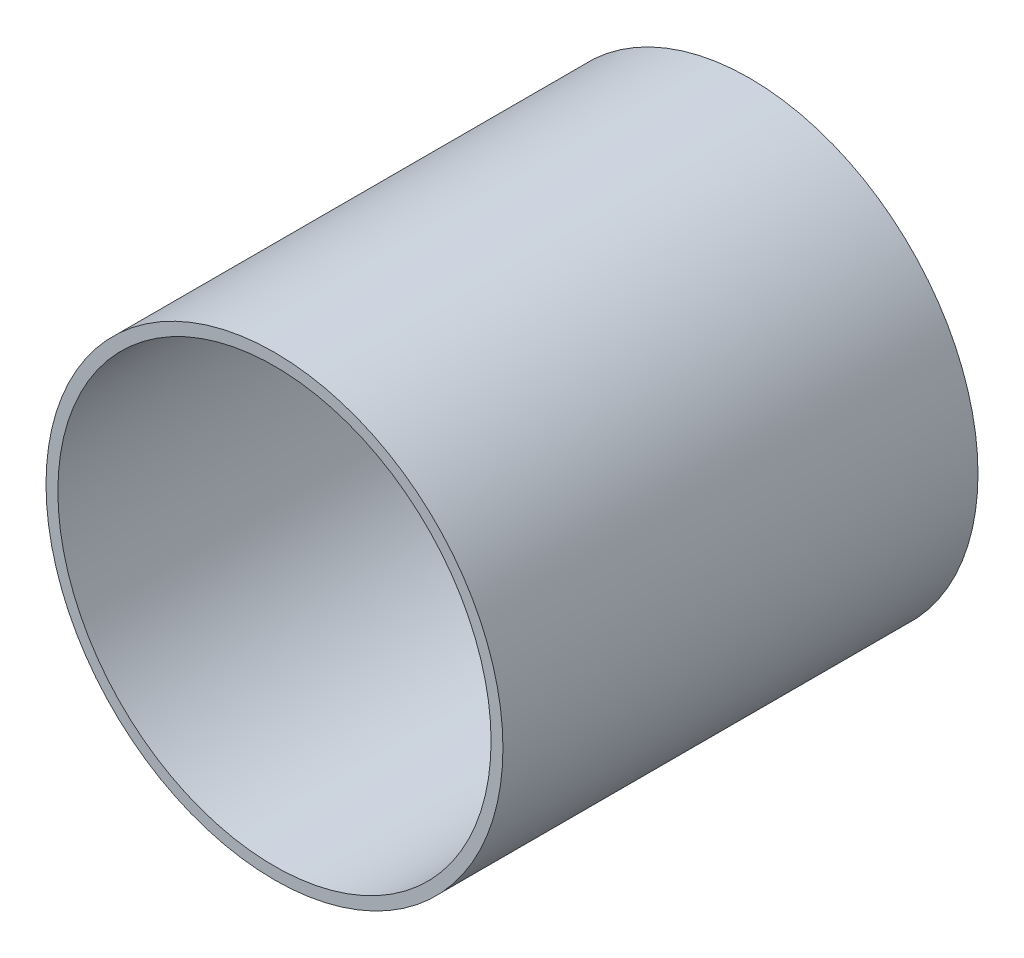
from build123d import *

# Parameters (mm, degrees)
SKETCH1_R           = 14.6685
SKETCH1_R_2         = 13.9065
EXTRUDE_THIN1_DEPTH = 15.25


with BuildPart() as part:
    # Sketch1 → Extrude-Thin1 (new, symmetric)
    with BuildSketch(Plane.XY):
        Circle(SKETCH1_R)
        Circle(SKETCH1_R_2, mode=Mode.SUBTRACT)
    extrude(amount=EXTRUDE_THIN1_DEPTH, both=True)


solid = part.part
